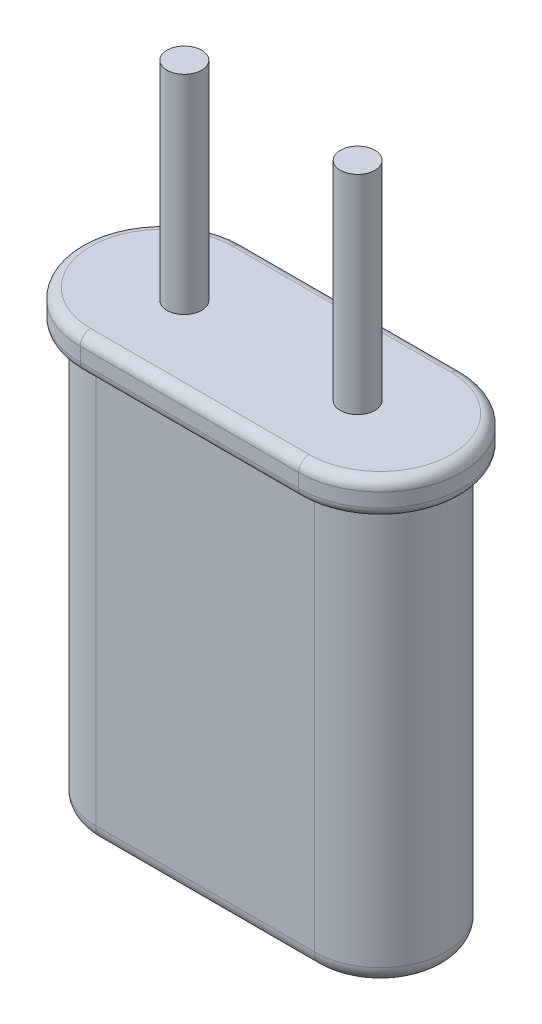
from build123d import *

# Parameters (mm, degrees)
EXTRUDE1_DEPTH = 1
EXTRUDE2_DEPTH = 12
FILLET1_R      = 0.3
FILLET2_R      = 0.5
SKETCH3_R      = 0.5
EXTRUDE3_DEPTH = 6


with BuildPart() as part:
    # Sketch1 → Extrude1 (new body)
    with BuildSketch(Plane(origin=(0, 0, 0), x_dir=(-1, 0, 0), z_dir=(0, 1, 0))):
        with BuildLine():
            Line((3.15, -2.35), (-3.15, -2.35))
            ThreePointArc((-3.15, -2.35), (-5.5, 0), (-3.15, 2.35))
            Line((-3.15, 2.35), (3.15, 2.35))
            ThreePointArc((3.15, 2.35), (5.5, 0), (3.15, -2.35))
        make_face()
    extrude(amount=-EXTRUDE1_DEPTH)

    # Sketch2 → Extrude2 (add)
    with BuildSketch(Plane.XZ.offset(1)):
        with BuildLine():
            Line((-3.15, -1.9), (3.15, -1.9))
            ThreePointArc((3.15, -1.9), (5.05, 0), (3.15, 1.9))
            Line((3.15, 1.9), (-3.15, 1.9))
            ThreePointArc((-3.15, 1.9), (-5.05, 0), (-3.15, -1.9))
        make_face()
    extrude(amount=EXTRUDE2_DEPTH)

    # Fillet1
    fillet1_edges = [part.edges().sort_by_distance(p)[0] for p in [
        (-5.5, -1, 0),
        (0, -1, 2.35),
        (5.5, -1, 0),
        (0, 0, 2.35),
        (-5.5, 0, 0),
        (0, 0, -2.35),
        (5.5, 0, 0),
        (0, -1, -2.35),
    ]]
    fillet(fillet1_edges, radius=FILLET1_R)

    # Fillet2
    fillet2_edges = [part.edges().sort_by_distance(p)[0] for p in [
        (5.05, -13, 0),
        (0, -13, 1.9),
        (-5.05, -13, 0),
        (0, -13, -1.9),
    ]]
    fillet(fillet2_edges, radius=FILLET2_R)

    # Sketch3 → Extrude3 (add)
    with BuildSketch(Plane(origin=(0, 0, 0), x_dir=(-1, 0, 0), z_dir=(0, 1, 0))):
        with Locations(Location((2.5, 0, 0), (0, 0, 90))):
            Circle(SKETCH3_R)
        with Locations(Location((-2.5, 0, 0), (0, 0, 270))):
            Circle(SKETCH3_R)
    extrude(amount=EXTRUDE3_DEPTH)


solid = part.part
